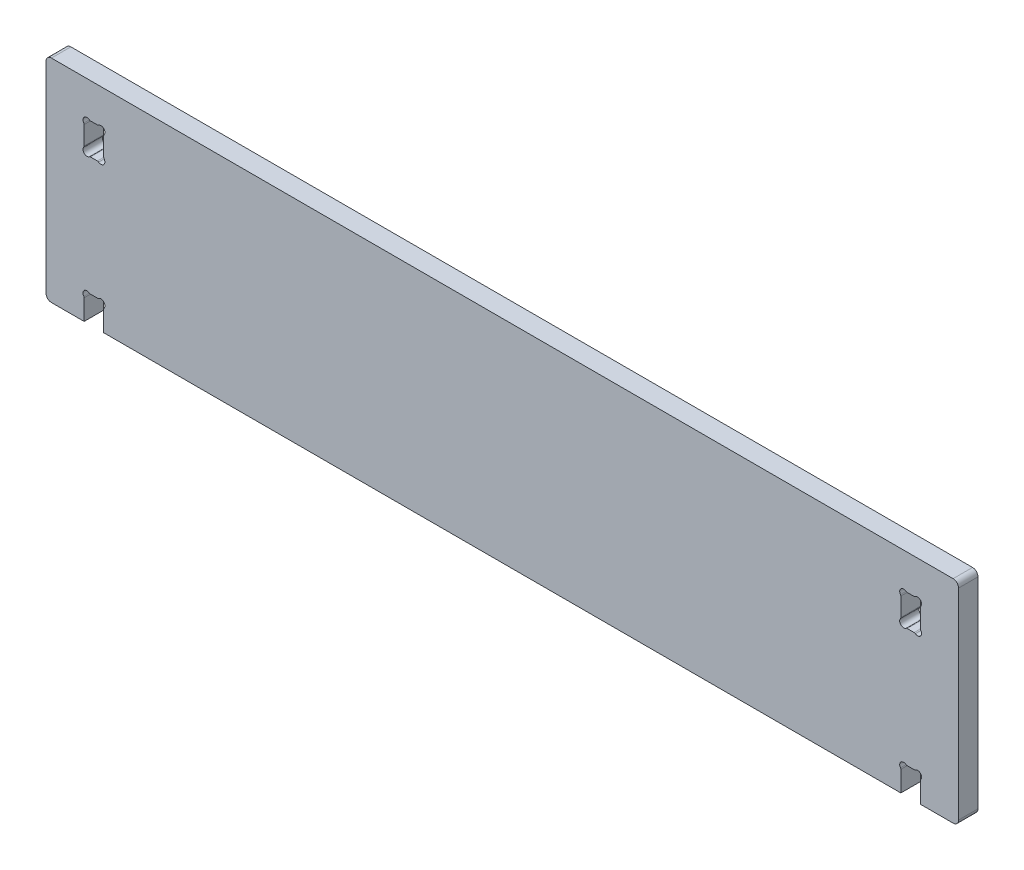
from build123d import *

# Parameters (mm, degrees)
BOSS_EXTRUDE1_DEPTH = 25
FILLET1_R           = 7


with BuildPart() as part:
    # Sketch1 → Boss-Extrude1 (new body)
    with BuildSketch(Plane.XY):
        with BuildLine():
            Line((587, -227.416666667), (74.266666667, -227.416666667))
            Line((74.266666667, -227.416666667), (74.266666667, -201.031040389))
            ThreePointArc((74.266666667, -201.031040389), (74.392684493, -200.247325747), (74.75803358, -199.542620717))
            ThreePointArc((74.75803358, -199.542620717), (74.266666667, -192.9), (67.62404595, -192.408633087))
            ThreePointArc((67.62404595, -192.408633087), (66.91934092, -192.773982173), (66.135626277, -192.9))
            Line((66.135626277, -192.9), (57.197707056, -192.9))
            ThreePointArc((57.197707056, -192.9), (56.413992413, -192.773982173), (55.709287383, -192.408633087))
            ThreePointArc((55.709287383, -192.408633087), (49.066666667, -192.9), (48.575299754, -199.542620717))
            ThreePointArc((48.575299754, -199.542620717), (48.94064884, -200.247325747), (49.066666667, -201.031040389))
            Line((49.066666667, -201.031040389), (49.066666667, -227.416666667))
            Line((49.066666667, -227.416666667), (0, -227.416666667))
            Line((0, -227.416666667), (0, 45))
            Line((0, 45), (587, 45))
            Line((587, 45), (587, -227.416666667))
        make_face()
        with BuildLine():
            Line((66.135626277, -40.1), (57.197707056, -40.1))
            ThreePointArc((57.197707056, -40.1), (56.413992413, -40.226017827), (55.709287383, -40.591366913))
            ThreePointArc((55.709287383, -40.591366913), (49.066666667, -40.1), (48.575299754, -33.457379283))
            ThreePointArc((48.575299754, -33.457379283), (48.94064884, -32.752674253), (49.066666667, -31.968959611))
            Line((49.066666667, -31.968959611), (49.066666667, -8.031040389))
            ThreePointArc((49.066666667, -8.031040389), (48.94064884, -7.247325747), (48.575299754, -6.542620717))
            ThreePointArc((48.575299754, -6.542620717), (49.066666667, 0.1), (55.709287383, 0.591366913))
            ThreePointArc((55.709287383, 0.591366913), (56.413992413, 0.226017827), (57.197707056, 0.1))
            Line((57.197707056, 0.1), (66.135626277, 0.1))
            ThreePointArc((66.135626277, 0.1), (66.91934092, 0.226017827), (67.62404595, 0.591366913))
            ThreePointArc((67.62404595, 0.591366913), (74.266666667, 0.1), (74.75803358, -6.542620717))
            ThreePointArc((74.75803358, -6.542620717), (74.392684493, -7.247325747), (74.266666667, -8.031040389))
            Line((74.266666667, -8.031040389), (74.266666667, -31.968959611))
            ThreePointArc((74.266666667, -31.968959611), (74.392684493, -32.752674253), (74.75803358, -33.457379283))
            ThreePointArc((74.75803358, -33.457379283), (74.266666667, -40.1), (67.62404595, -40.591366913))
            ThreePointArc((67.62404595, -40.591366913), (66.91934092, -40.226017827), (66.135626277, -40.1))
        make_face(mode=Mode.SUBTRACT)
    extrude(amount=BOSS_EXTRUDE1_DEPTH)

    # Fillet1
    fillet1_edges = [part.edges().sort_by_distance(p)[0] for p in [
        (0, -227.416666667, 12.5),
        (0, 45, 12.5),
    ]]
    fillet(fillet1_edges, radius=FILLET1_R)

    # Sym_trie1: part across plane


with BuildPart() as part_1:
    add(part.part)
    add(part.part.mirror(Plane(origin=(587, 45, 25), x_dir=(0, 0, 1), z_dir=(-1, 0, 0))))


solid = part_1.part
